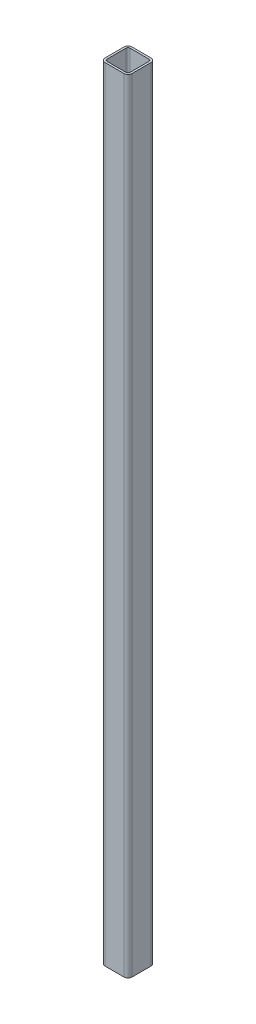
ISO-10303-21;
HEADER;
FILE_DESCRIPTION(('STEP AP214'),'2;1');
FILE_NAME('part.step','',(''),(''),'','','');
FILE_SCHEMA(('AUTOMOTIVE_DESIGN { 1 0 10303 214 1 1 1 1 }'));
ENDSEC;
DATA;
#1=APPLICATION_CONTEXT('core data for automotive mechanical design processes');
#2=APPLICATION_PROTOCOL_DEFINITION('international standard','automotive_design',2000,#1);
#3=PRODUCT_CONTEXT('',#1,'mechanical');
#4=PRODUCT('Part','Part','',(#3));
#5=PRODUCT_RELATED_PRODUCT_CATEGORY('part','',(#4));
#6=PRODUCT_DEFINITION_FORMATION('','',#4);
#7=PRODUCT_DEFINITION_CONTEXT('part definition',#1,'design');
#8=PRODUCT_DEFINITION('design','',#6,#7);
#9=PRODUCT_DEFINITION_SHAPE('','',#8);
#10=(LENGTH_UNIT() NAMED_UNIT(*) SI_UNIT(.MILLI.,.METRE.));
#11=(NAMED_UNIT(*) PLANE_ANGLE_UNIT() SI_UNIT($,.RADIAN.));
#12=(NAMED_UNIT(*) SI_UNIT($,.STERADIAN.) SOLID_ANGLE_UNIT());
#13=UNCERTAINTY_MEASURE_WITH_UNIT(LENGTH_MEASURE(1.E-05),#10,'distance_accuracy_value','');
#14=(GEOMETRIC_REPRESENTATION_CONTEXT(3) GLOBAL_UNCERTAINTY_ASSIGNED_CONTEXT((#13)) GLOBAL_UNIT_ASSIGNED_CONTEXT((#10,
#11,#12)) REPRESENTATION_CONTEXT('',''));
#15=CARTESIAN_POINT('',(0.,0.,0.));
#16=DIRECTION('',(0.,0.,1.));
#17=DIRECTION('',(1.,0.,0.));
#18=AXIS2_PLACEMENT_3D('',#15,#16,#17);
#19=CARTESIAN_POINT('',(-6.9999999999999,289.5,-7.00000000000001));
#20=DIRECTION('',(0.,1.,0.));
#21=DIRECTION('',(0.,0.,1.));
#22=AXIS2_PLACEMENT_3D('',#19,#20,#21);
#23=PLANE('',#22);
#24=CARTESIAN_POINT('',(-6.9999999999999,289.5,-7.00000000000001));
#25=DIRECTION('',(0.,1.,0.));
#26=DIRECTION('',(0.,0.,1.));
#27=AXIS2_PLACEMENT_3D('',#24,#25,#26);
#28=CIRCLE('',#27,3.);
#29=CARTESIAN_POINT('',(-6.9999999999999,289.5,-10.));
#30=VERTEX_POINT('',#29);
#31=CARTESIAN_POINT('',(-9.9999999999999,289.5,-7.00000000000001));
#32=VERTEX_POINT('',#31);
#33=EDGE_CURVE('E312',#30,#32,#28,.T.);
#34=ORIENTED_EDGE('',*,*,#33,.T.);
#35=DIRECTION('',(0.,0.,1.));
#36=VECTOR('',#35,1.);
#37=CARTESIAN_POINT('',(-9.9999999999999,289.5,7.00000000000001));
#38=LINE('',#37,#36);
#39=CARTESIAN_POINT('',(-9.9999999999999,289.5,7.00000000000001));
#40=VERTEX_POINT('',#39);
#41=EDGE_CURVE('E316',#32,#40,#38,.T.);
#42=ORIENTED_EDGE('',*,*,#41,.T.);
#43=CARTESIAN_POINT('',(-6.9999999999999,289.5,7.00000000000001));
#44=DIRECTION('',(0.,1.,0.));
#45=DIRECTION('',(0.,0.,-1.));
#46=AXIS2_PLACEMENT_3D('',#43,#44,#45);
#47=CIRCLE('',#46,3.);
#48=CARTESIAN_POINT('',(-6.9999999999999,289.5,10.));
#49=VERTEX_POINT('',#48);
#50=EDGE_CURVE('E319',#40,#49,#47,.T.);
#51=ORIENTED_EDGE('',*,*,#50,.T.);
#52=DIRECTION('',(1.,0.,0.));
#53=VECTOR('',#52,1.);
#54=CARTESIAN_POINT('',(-6.9999999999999,289.5,10.));
#55=LINE('',#54,#53);
#56=CARTESIAN_POINT('',(7.00000000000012,289.5,10.));
#57=VERTEX_POINT('',#56);
#58=EDGE_CURVE('E322',#49,#57,#55,.T.);
#59=ORIENTED_EDGE('',*,*,#58,.T.);
#60=CARTESIAN_POINT('',(7.00000000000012,289.5,7.00000000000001));
#61=DIRECTION('',(0.,1.,0.));
#62=DIRECTION('',(0.,0.,-1.));
#63=AXIS2_PLACEMENT_3D('',#60,#61,#62);
#64=CIRCLE('',#63,3.);
#65=CARTESIAN_POINT('',(10.0000000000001,289.5,7.00000000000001));
#66=VERTEX_POINT('',#65);
#67=EDGE_CURVE('E325',#57,#66,#64,.T.);
#68=ORIENTED_EDGE('',*,*,#67,.T.);
#69=DIRECTION('',(0.,0.,-1.));
#70=VECTOR('',#69,1.);
#71=CARTESIAN_POINT('',(10.0000000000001,289.5,7.00000000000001));
#72=LINE('',#71,#70);
#73=CARTESIAN_POINT('',(10.0000000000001,289.5,-7.00000000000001));
#74=VERTEX_POINT('',#73);
#75=EDGE_CURVE('E328',#66,#74,#72,.T.);
#76=ORIENTED_EDGE('',*,*,#75,.T.);
#77=CARTESIAN_POINT('',(7.00000000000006,289.5,-7.00000000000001));
#78=DIRECTION('',(0.,1.,0.));
#79=DIRECTION('',(0.,0.,1.));
#80=AXIS2_PLACEMENT_3D('',#77,#78,#79);
#81=CIRCLE('',#80,3.);
#82=CARTESIAN_POINT('',(7.00000000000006,289.5,-10.));
#83=VERTEX_POINT('',#82);
#84=EDGE_CURVE('E331',#74,#83,#81,.T.);
#85=ORIENTED_EDGE('',*,*,#84,.T.);
#86=DIRECTION('',(-1.,0.,0.));
#87=VECTOR('',#86,1.);
#88=CARTESIAN_POINT('',(-6.9999999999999,289.5,-10.));
#89=LINE('',#88,#87);
#90=EDGE_CURVE('E334',#83,#30,#89,.T.);
#91=ORIENTED_EDGE('',*,*,#90,.T.);
#92=EDGE_LOOP('',(#34,#42,#51,#59,#68,#76,#85,#91));
#93=FACE_BOUND('',#92,.T.);
#94=DIRECTION('',(0.,0.,1.));
#95=VECTOR('',#94,1.);
#96=CARTESIAN_POINT('',(-8.4999999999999,289.5,7.00000000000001));
#97=LINE('',#96,#95);
#98=CARTESIAN_POINT('',(-8.4999999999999,289.5,-7.00000000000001));
#99=VERTEX_POINT('',#98);
#100=CARTESIAN_POINT('',(-8.4999999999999,289.5,7.00000000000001));
#101=VERTEX_POINT('',#100);
#102=EDGE_CURVE('E250',#99,#101,#97,.T.);
#103=ORIENTED_EDGE('',*,*,#102,.F.);
#104=CARTESIAN_POINT('',(-6.9999999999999,289.5,-7.00000000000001));
#105=DIRECTION('',(0.,1.,0.));
#106=DIRECTION('',(1.,0.,0.));
#107=AXIS2_PLACEMENT_3D('',#104,#105,#106);
#108=CIRCLE('',#107,1.5);
#109=CARTESIAN_POINT('',(-6.9999999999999,289.5,-8.50000000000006));
#110=VERTEX_POINT('',#109);
#111=EDGE_CURVE('E216',#110,#99,#108,.T.);
#112=ORIENTED_EDGE('',*,*,#111,.F.);
#113=DIRECTION('',(-1.,0.,0.));
#114=VECTOR('',#113,1.);
#115=CARTESIAN_POINT('',(-6.9999999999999,289.5,-8.50000000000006));
#116=LINE('',#115,#114);
#117=CARTESIAN_POINT('',(7.00000000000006,289.5,-8.50000000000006));
#118=VERTEX_POINT('',#117);
#119=EDGE_CURVE('E268',#118,#110,#116,.T.);
#120=ORIENTED_EDGE('',*,*,#119,.F.);
#121=CARTESIAN_POINT('',(7.00000000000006,289.5,-7.00000000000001));
#122=DIRECTION('',(0.,1.,0.));
#123=DIRECTION('',(1.,0.,0.));
#124=AXIS2_PLACEMENT_3D('',#121,#122,#123);
#125=CIRCLE('',#124,1.5);
#126=CARTESIAN_POINT('',(8.50000000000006,289.5,-7.00000000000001));
#127=VERTEX_POINT('',#126);
#128=EDGE_CURVE('E265',#127,#118,#125,.T.);
#129=ORIENTED_EDGE('',*,*,#128,.F.);
#130=DIRECTION('',(0.,0.,-1.));
#131=VECTOR('',#130,1.);
#132=CARTESIAN_POINT('',(8.50000000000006,289.5,7.00000000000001));
#133=LINE('',#132,#131);
#134=CARTESIAN_POINT('',(8.50000000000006,289.5,7.00000000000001));
#135=VERTEX_POINT('',#134);
#136=EDGE_CURVE('E262',#135,#127,#133,.T.);
#137=ORIENTED_EDGE('',*,*,#136,.F.);
#138=CARTESIAN_POINT('',(7.00000000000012,289.5,7.00000000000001));
#139=DIRECTION('',(0.,1.,0.));
#140=DIRECTION('',(1.,0.,0.));
#141=AXIS2_PLACEMENT_3D('',#138,#139,#140);
#142=CIRCLE('',#141,1.5);
#143=CARTESIAN_POINT('',(7.00000000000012,289.5,8.49999999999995));
#144=VERTEX_POINT('',#143);
#145=EDGE_CURVE('E259',#144,#135,#142,.T.);
#146=ORIENTED_EDGE('',*,*,#145,.F.);
#147=DIRECTION('',(1.,0.,0.));
#148=VECTOR('',#147,1.);
#149=CARTESIAN_POINT('',(-6.9999999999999,289.5,8.49999999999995));
#150=LINE('',#149,#148);
#151=CARTESIAN_POINT('',(-6.9999999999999,289.5,8.49999999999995));
#152=VERTEX_POINT('',#151);
#153=EDGE_CURVE('E256',#152,#144,#150,.T.);
#154=ORIENTED_EDGE('',*,*,#153,.F.);
#155=CARTESIAN_POINT('',(-6.9999999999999,289.5,7.00000000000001));
#156=DIRECTION('',(0.,1.,0.));
#157=DIRECTION('',(1.,0.,0.));
#158=AXIS2_PLACEMENT_3D('',#155,#156,#157);
#159=CIRCLE('',#158,1.5);
#160=EDGE_CURVE('E253',#101,#152,#159,.T.);
#161=ORIENTED_EDGE('',*,*,#160,.F.);
#162=EDGE_LOOP('',(#103,#112,#120,#129,#137,#146,#154,#161));
#163=FACE_BOUND('',#162,.T.);
#164=ADVANCED_FACE('F86',(#93,#163),#23,.T.);
#165=CARTESIAN_POINT('',(-7.00000000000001,-289.5,-6.99999999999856));
#166=DIRECTION('',(0.,1.,0.));
#167=DIRECTION('',(0.,0.,1.));
#168=AXIS2_PLACEMENT_3D('',#165,#166,#167);
#169=PLANE('',#168);
#170=CARTESIAN_POINT('',(-7.00000000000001,-289.5,-6.99999999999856));
#171=DIRECTION('',(0.,1.,0.));
#172=DIRECTION('',(0.,0.,1.));
#173=AXIS2_PLACEMENT_3D('',#170,#171,#172);
#174=CIRCLE('',#173,3.);
#175=CARTESIAN_POINT('',(-7.00000000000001,-289.5,-9.99999999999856));
#176=VERTEX_POINT('',#175);
#177=CARTESIAN_POINT('',(-9.99999999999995,-289.5,-6.99999999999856));
#178=VERTEX_POINT('',#177);
#179=EDGE_CURVE('E218',#176,#178,#174,.T.);
#180=ORIENTED_EDGE('',*,*,#179,.F.);
#181=DIRECTION('',(-1.,0.,0.));
#182=VECTOR('',#181,1.);
#183=CARTESIAN_POINT('',(-7.00000000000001,-289.5,-9.99999999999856));
#184=LINE('',#183,#182);
#185=CARTESIAN_POINT('',(7.00000000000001,-289.5,-9.99999999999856));
#186=VERTEX_POINT('',#185);
#187=EDGE_CURVE('E309',#186,#176,#184,.T.);
#188=ORIENTED_EDGE('',*,*,#187,.F.);
#189=CARTESIAN_POINT('',(7.00000000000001,-289.5,-6.99999999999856));
#190=DIRECTION('',(0.,1.,0.));
#191=DIRECTION('',(0.,0.,1.));
#192=AXIS2_PLACEMENT_3D('',#189,#190,#191);
#193=CIRCLE('',#192,3.);
#194=CARTESIAN_POINT('',(10.,-289.5,-6.99999999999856));
#195=VERTEX_POINT('',#194);
#196=EDGE_CURVE('E306',#195,#186,#193,.T.);
#197=ORIENTED_EDGE('',*,*,#196,.F.);
#198=DIRECTION('',(0.,0.,-1.));
#199=VECTOR('',#198,1.);
#200=CARTESIAN_POINT('',(10.,-289.5,7.00000000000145));
#201=LINE('',#200,#199);
#202=CARTESIAN_POINT('',(10.,-289.5,7.00000000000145));
#203=VERTEX_POINT('',#202);
#204=EDGE_CURVE('E303',#203,#195,#201,.T.);
#205=ORIENTED_EDGE('',*,*,#204,.F.);
#206=CARTESIAN_POINT('',(7.00000000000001,-289.5,7.00000000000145));
#207=DIRECTION('',(0.,1.,0.));
#208=DIRECTION('',(0.,0.,-1.));
#209=AXIS2_PLACEMENT_3D('',#206,#207,#208);
#210=CIRCLE('',#209,3.);
#211=CARTESIAN_POINT('',(7.00000000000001,-289.5,10.0000000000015));
#212=VERTEX_POINT('',#211);
#213=EDGE_CURVE('E300',#212,#203,#210,.T.);
#214=ORIENTED_EDGE('',*,*,#213,.F.);
#215=DIRECTION('',(1.,0.,0.));
#216=VECTOR('',#215,1.);
#217=CARTESIAN_POINT('',(-6.99999999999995,-289.5,10.0000000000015));
#218=LINE('',#217,#216);
#219=CARTESIAN_POINT('',(-6.99999999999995,-289.5,10.0000000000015));
#220=VERTEX_POINT('',#219);
#221=EDGE_CURVE('E297',#220,#212,#218,.T.);
#222=ORIENTED_EDGE('',*,*,#221,.F.);
#223=CARTESIAN_POINT('',(-6.99999999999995,-289.5,7.00000000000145));
#224=DIRECTION('',(0.,1.,0.));
#225=DIRECTION('',(0.,0.,-1.));
#226=AXIS2_PLACEMENT_3D('',#223,#224,#225);
#227=CIRCLE('',#226,3.);
#228=CARTESIAN_POINT('',(-9.99999999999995,-289.5,7.00000000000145));
#229=VERTEX_POINT('',#228);
#230=EDGE_CURVE('E294',#229,#220,#227,.T.);
#231=ORIENTED_EDGE('',*,*,#230,.F.);
#232=DIRECTION('',(0.,0.,1.));
#233=VECTOR('',#232,1.);
#234=CARTESIAN_POINT('',(-9.99999999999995,-289.5,7.00000000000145));
#235=LINE('',#234,#233);
#236=EDGE_CURVE('E292',#178,#229,#235,.T.);
#237=ORIENTED_EDGE('',*,*,#236,.F.);
#238=EDGE_LOOP('',(#180,#188,#197,#205,#214,#222,#231,#237));
#239=FACE_BOUND('',#238,.T.);
#240=CARTESIAN_POINT('',(-7.00000000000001,-289.5,-6.99999999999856));
#241=DIRECTION('',(0.,1.,0.));
#242=DIRECTION('',(1.,0.,0.));
#243=AXIS2_PLACEMENT_3D('',#240,#241,#242);
#244=CIRCLE('',#243,1.5);
#245=CARTESIAN_POINT('',(-7.00000000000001,-289.5,-8.49999999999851));
#246=VERTEX_POINT('',#245);
#247=CARTESIAN_POINT('',(-8.49999999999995,-289.5,-6.99999999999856));
#248=VERTEX_POINT('',#247);
#249=EDGE_CURVE('E110',#246,#248,#244,.T.);
#250=ORIENTED_EDGE('',*,*,#249,.T.);
#251=DIRECTION('',(0.,0.,1.));
#252=VECTOR('',#251,1.);
#253=CARTESIAN_POINT('',(-8.49999999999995,-289.5,7.00000000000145));
#254=LINE('',#253,#252);
#255=CARTESIAN_POINT('',(-8.49999999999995,-289.5,7.00000000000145));
#256=VERTEX_POINT('',#255);
#257=EDGE_CURVE('E202',#248,#256,#254,.T.);
#258=ORIENTED_EDGE('',*,*,#257,.T.);
#259=CARTESIAN_POINT('',(-6.99999999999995,-289.5,7.00000000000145));
#260=DIRECTION('',(0.,1.,0.));
#261=DIRECTION('',(1.,0.,0.));
#262=AXIS2_PLACEMENT_3D('',#259,#260,#261);
#263=CIRCLE('',#262,1.5);
#264=CARTESIAN_POINT('',(-6.99999999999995,-289.5,8.50000000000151));
#265=VERTEX_POINT('',#264);
#266=EDGE_CURVE('E212',#256,#265,#263,.T.);
#267=ORIENTED_EDGE('',*,*,#266,.T.);
#268=DIRECTION('',(1.,0.,0.));
#269=VECTOR('',#268,1.);
#270=CARTESIAN_POINT('',(-6.99999999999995,-289.5,8.50000000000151));
#271=LINE('',#270,#269);
#272=CARTESIAN_POINT('',(7.00000000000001,-289.5,8.50000000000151));
#273=VERTEX_POINT('',#272);
#274=EDGE_CURVE('E231',#265,#273,#271,.T.);
#275=ORIENTED_EDGE('',*,*,#274,.T.);
#276=CARTESIAN_POINT('',(7.00000000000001,-289.5,7.00000000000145));
#277=DIRECTION('',(0.,1.,0.));
#278=DIRECTION('',(1.,0.,0.));
#279=AXIS2_PLACEMENT_3D('',#276,#277,#278);
#280=CIRCLE('',#279,1.5);
#281=CARTESIAN_POINT('',(8.50000000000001,-289.5,7.00000000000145));
#282=VERTEX_POINT('',#281);
#283=EDGE_CURVE('E235',#273,#282,#280,.T.);
#284=ORIENTED_EDGE('',*,*,#283,.T.);
#285=DIRECTION('',(0.,0.,-1.));
#286=VECTOR('',#285,1.);
#287=CARTESIAN_POINT('',(8.50000000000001,-289.5,7.00000000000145));
#288=LINE('',#287,#286);
#289=CARTESIAN_POINT('',(8.50000000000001,-289.5,-6.99999999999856));
#290=VERTEX_POINT('',#289);
#291=EDGE_CURVE('E239',#282,#290,#288,.T.);
#292=ORIENTED_EDGE('',*,*,#291,.T.);
#293=CARTESIAN_POINT('',(7.00000000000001,-289.5,-6.99999999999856));
#294=DIRECTION('',(0.,1.,0.));
#295=DIRECTION('',(1.,0.,0.));
#296=AXIS2_PLACEMENT_3D('',#293,#294,#295);
#297=CIRCLE('',#296,1.5);
#298=CARTESIAN_POINT('',(7.00000000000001,-289.5,-8.49999999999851));
#299=VERTEX_POINT('',#298);
#300=EDGE_CURVE('E243',#290,#299,#297,.T.);
#301=ORIENTED_EDGE('',*,*,#300,.T.);
#302=DIRECTION('',(-1.,0.,0.));
#303=VECTOR('',#302,1.);
#304=CARTESIAN_POINT('',(-7.00000000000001,-289.5,-8.49999999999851));
#305=LINE('',#304,#303);
#306=EDGE_CURVE('E223',#299,#246,#305,.T.);
#307=ORIENTED_EDGE('',*,*,#306,.T.);
#308=EDGE_LOOP('',(#250,#258,#267,#275,#284,#292,#301,#307));
#309=FACE_BOUND('',#308,.T.);
#310=ADVANCED_FACE('F221',(#239,#309),#169,.F.);
#311=CARTESIAN_POINT('',(-6.9999999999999,289.5,-7.00000000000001));
#312=DIRECTION('',(0.,-1.,0.));
#313=DIRECTION('',(0.,0.,-1.));
#314=AXIS2_PLACEMENT_3D('',#311,#312,#313);
#315=CYLINDRICAL_SURFACE('',#314,3.);
#316=ORIENTED_EDGE('',*,*,#179,.T.);
#317=DIRECTION('',(0.,-1.,0.));
#318=VECTOR('',#317,1.);
#319=CARTESIAN_POINT('',(-9.9999999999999,289.5,-7.00000000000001));
#320=LINE('',#319,#318);
#321=EDGE_CURVE('E12',#32,#178,#320,.T.);
#322=ORIENTED_EDGE('',*,*,#321,.F.);
#323=ORIENTED_EDGE('',*,*,#33,.F.);
#324=DIRECTION('',(0.,-1.,0.));
#325=VECTOR('',#324,1.);
#326=CARTESIAN_POINT('',(-6.9999999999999,289.5,-10.));
#327=LINE('',#326,#325);
#328=EDGE_CURVE('E337',#30,#176,#327,.T.);
#329=ORIENTED_EDGE('',*,*,#328,.T.);
#330=EDGE_LOOP('',(#316,#322,#323,#329));
#331=FACE_BOUND('',#330,.T.);
#332=ADVANCED_FACE('F88',(#331),#315,.T.);
#333=CARTESIAN_POINT('',(-9.9999999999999,289.5,7.00000000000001));
#334=DIRECTION('',(1.,0.,0.));
#335=DIRECTION('',(0.,0.,-1.));
#336=AXIS2_PLACEMENT_3D('',#333,#334,#335);
#337=PLANE('',#336);
#338=ORIENTED_EDGE('',*,*,#236,.T.);
#339=DIRECTION('',(0.,-1.,0.));
#340=VECTOR('',#339,1.);
#341=CARTESIAN_POINT('',(-9.9999999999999,289.5,7.00000000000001));
#342=LINE('',#341,#340);
#343=EDGE_CURVE('E95',#40,#229,#342,.T.);
#344=ORIENTED_EDGE('',*,*,#343,.F.);
#345=ORIENTED_EDGE('',*,*,#41,.F.);
#346=ORIENTED_EDGE('',*,*,#321,.T.);
#347=EDGE_LOOP('',(#338,#344,#345,#346));
#348=FACE_BOUND('',#347,.T.);
#349=ADVANCED_FACE('F388',(#348),#337,.F.);
#350=CARTESIAN_POINT('',(-6.9999999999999,289.5,7.00000000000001));
#351=DIRECTION('',(0.,-1.,0.));
#352=DIRECTION('',(0.,0.,-1.));
#353=AXIS2_PLACEMENT_3D('',#350,#351,#352);
#354=CYLINDRICAL_SURFACE('',#353,3.);
#355=ORIENTED_EDGE('',*,*,#230,.T.);
#356=DIRECTION('',(0.,-1.,0.));
#357=VECTOR('',#356,1.);
#358=CARTESIAN_POINT('',(-6.9999999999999,289.5,10.));
#359=LINE('',#358,#357);
#360=EDGE_CURVE('E357',#49,#220,#359,.T.);
#361=ORIENTED_EDGE('',*,*,#360,.F.);
#362=ORIENTED_EDGE('',*,*,#50,.F.);
#363=ORIENTED_EDGE('',*,*,#343,.T.);
#364=EDGE_LOOP('',(#355,#361,#362,#363));
#365=FACE_BOUND('',#364,.T.);
#366=ADVANCED_FACE('F366',(#365),#354,.T.);
#367=CARTESIAN_POINT('',(-6.9999999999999,289.5,10.));
#368=DIRECTION('',(0.,0.,-1.));
#369=DIRECTION('',(-1.,0.,0.));
#370=AXIS2_PLACEMENT_3D('',#367,#368,#369);
#371=PLANE('',#370);
#372=ORIENTED_EDGE('',*,*,#221,.T.);
#373=DIRECTION('',(0.,-1.,0.));
#374=VECTOR('',#373,1.);
#375=CARTESIAN_POINT('',(7.00000000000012,289.5,10.));
#376=LINE('',#375,#374);
#377=EDGE_CURVE('E353',#57,#212,#376,.T.);
#378=ORIENTED_EDGE('',*,*,#377,.F.);
#379=ORIENTED_EDGE('',*,*,#58,.F.);
#380=ORIENTED_EDGE('',*,*,#360,.T.);
#381=EDGE_LOOP('',(#372,#378,#379,#380));
#382=FACE_BOUND('',#381,.T.);
#383=ADVANCED_FACE('F376',(#382),#371,.F.);
#384=CARTESIAN_POINT('',(7.00000000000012,289.5,7.00000000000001));
#385=DIRECTION('',(0.,-1.,0.));
#386=DIRECTION('',(0.,0.,-1.));
#387=AXIS2_PLACEMENT_3D('',#384,#385,#386);
#388=CYLINDRICAL_SURFACE('',#387,3.);
#389=ORIENTED_EDGE('',*,*,#213,.T.);
#390=DIRECTION('',(0.,-1.,0.));
#391=VECTOR('',#390,1.);
#392=CARTESIAN_POINT('',(10.0000000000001,289.5,7.00000000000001));
#393=LINE('',#392,#391);
#394=EDGE_CURVE('E349',#66,#203,#393,.T.);
#395=ORIENTED_EDGE('',*,*,#394,.F.);
#396=ORIENTED_EDGE('',*,*,#67,.F.);
#397=ORIENTED_EDGE('',*,*,#377,.T.);
#398=EDGE_LOOP('',(#389,#395,#396,#397));
#399=FACE_BOUND('',#398,.T.);
#400=ADVANCED_FACE('F380',(#399),#388,.T.);
#401=CARTESIAN_POINT('',(10.0000000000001,289.5,7.00000000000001));
#402=DIRECTION('',(-1.,0.,0.));
#403=DIRECTION('',(0.,0.,1.));
#404=AXIS2_PLACEMENT_3D('',#401,#402,#403);
#405=PLANE('',#404);
#406=ORIENTED_EDGE('',*,*,#204,.T.);
#407=DIRECTION('',(0.,-1.,0.));
#408=VECTOR('',#407,1.);
#409=CARTESIAN_POINT('',(10.0000000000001,289.5,-7.00000000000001));
#410=LINE('',#409,#408);
#411=EDGE_CURVE('E345',#74,#195,#410,.T.);
#412=ORIENTED_EDGE('',*,*,#411,.F.);
#413=ORIENTED_EDGE('',*,*,#75,.F.);
#414=ORIENTED_EDGE('',*,*,#394,.T.);
#415=EDGE_LOOP('',(#406,#412,#413,#414));
#416=FACE_BOUND('',#415,.T.);
#417=ADVANCED_FACE('F401',(#416),#405,.F.);
#418=CARTESIAN_POINT('',(7.00000000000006,289.5,-7.00000000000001));
#419=DIRECTION('',(0.,-1.,0.));
#420=DIRECTION('',(0.,0.,-1.));
#421=AXIS2_PLACEMENT_3D('',#418,#419,#420);
#422=CYLINDRICAL_SURFACE('',#421,3.);
#423=ORIENTED_EDGE('',*,*,#196,.T.);
#424=DIRECTION('',(0.,-1.,0.));
#425=VECTOR('',#424,1.);
#426=CARTESIAN_POINT('',(7.00000000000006,289.5,-10.));
#427=LINE('',#426,#425);
#428=EDGE_CURVE('E341',#83,#186,#427,.T.);
#429=ORIENTED_EDGE('',*,*,#428,.F.);
#430=ORIENTED_EDGE('',*,*,#84,.F.);
#431=ORIENTED_EDGE('',*,*,#411,.T.);
#432=EDGE_LOOP('',(#423,#429,#430,#431));
#433=FACE_BOUND('',#432,.T.);
#434=ADVANCED_FACE('F399',(#433),#422,.T.);
#435=CARTESIAN_POINT('',(-6.9999999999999,289.5,-10.));
#436=DIRECTION('',(0.,0.,1.));
#437=DIRECTION('',(1.,0.,0.));
#438=AXIS2_PLACEMENT_3D('',#435,#436,#437);
#439=PLANE('',#438);
#440=ORIENTED_EDGE('',*,*,#187,.T.);
#441=ORIENTED_EDGE('',*,*,#328,.F.);
#442=ORIENTED_EDGE('',*,*,#90,.F.);
#443=ORIENTED_EDGE('',*,*,#428,.T.);
#444=EDGE_LOOP('',(#440,#441,#442,#443));
#445=FACE_BOUND('',#444,.T.);
#446=ADVANCED_FACE('F394',(#445),#439,.F.);
#447=CARTESIAN_POINT('',(-6.9999999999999,289.5,-7.00000000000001));
#448=DIRECTION('',(0.,-1.,0.));
#449=DIRECTION('',(0.,0.,-1.));
#450=AXIS2_PLACEMENT_3D('',#447,#448,#449);
#451=CYLINDRICAL_SURFACE('',#450,1.5);
#452=ORIENTED_EDGE('',*,*,#249,.F.);
#453=DIRECTION('',(0.,-1.,0.));
#454=VECTOR('',#453,1.);
#455=CARTESIAN_POINT('',(-6.9999999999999,289.5,-8.50000000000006));
#456=LINE('',#455,#454);
#457=EDGE_CURVE('E271',#110,#246,#456,.T.);
#458=ORIENTED_EDGE('',*,*,#457,.F.);
#459=ORIENTED_EDGE('',*,*,#111,.T.);
#460=DIRECTION('',(0.,-1.,0.));
#461=VECTOR('',#460,1.);
#462=CARTESIAN_POINT('',(-8.4999999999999,289.5,-7.00000000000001));
#463=LINE('',#462,#461);
#464=EDGE_CURVE('E204',#99,#248,#463,.T.);
#465=ORIENTED_EDGE('',*,*,#464,.T.);
#466=EDGE_LOOP('',(#452,#458,#459,#465));
#467=FACE_BOUND('',#466,.T.);
#468=ADVANCED_FACE('F214',(#467),#451,.F.);
#469=CARTESIAN_POINT('',(-8.4999999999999,289.5,7.00000000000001));
#470=DIRECTION('',(1.,0.,0.));
#471=DIRECTION('',(0.,0.,-1.));
#472=AXIS2_PLACEMENT_3D('',#469,#470,#471);
#473=PLANE('',#472);
#474=ORIENTED_EDGE('',*,*,#257,.F.);
#475=ORIENTED_EDGE('',*,*,#464,.F.);
#476=ORIENTED_EDGE('',*,*,#102,.T.);
#477=DIRECTION('',(0.,-1.,0.));
#478=VECTOR('',#477,1.);
#479=CARTESIAN_POINT('',(-8.4999999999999,289.5,7.00000000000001));
#480=LINE('',#479,#478);
#481=EDGE_CURVE('E207',#101,#256,#480,.T.);
#482=ORIENTED_EDGE('',*,*,#481,.T.);
#483=EDGE_LOOP('',(#474,#475,#476,#482));
#484=FACE_BOUND('',#483,.T.);
#485=ADVANCED_FACE('F203',(#484),#473,.T.);
#486=CARTESIAN_POINT('',(-6.9999999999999,289.5,7.00000000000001));
#487=DIRECTION('',(0.,-1.,0.));
#488=DIRECTION('',(0.,0.,-1.));
#489=AXIS2_PLACEMENT_3D('',#486,#487,#488);
#490=CYLINDRICAL_SURFACE('',#489,1.5);
#491=ORIENTED_EDGE('',*,*,#266,.F.);
#492=ORIENTED_EDGE('',*,*,#481,.F.);
#493=ORIENTED_EDGE('',*,*,#160,.T.);
#494=DIRECTION('',(0.,-1.,0.));
#495=VECTOR('',#494,1.);
#496=CARTESIAN_POINT('',(-6.9999999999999,289.5,8.49999999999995));
#497=LINE('',#496,#495);
#498=EDGE_CURVE('E284',#152,#265,#497,.T.);
#499=ORIENTED_EDGE('',*,*,#498,.T.);
#500=EDGE_LOOP('',(#491,#492,#493,#499));
#501=FACE_BOUND('',#500,.T.);
#502=ADVANCED_FACE('F425',(#501),#490,.F.);
#503=CARTESIAN_POINT('',(-6.9999999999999,289.5,8.49999999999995));
#504=DIRECTION('',(0.,0.,-1.));
#505=DIRECTION('',(-1.,0.,0.));
#506=AXIS2_PLACEMENT_3D('',#503,#504,#505);
#507=PLANE('',#506);
#508=ORIENTED_EDGE('',*,*,#274,.F.);
#509=ORIENTED_EDGE('',*,*,#498,.F.);
#510=ORIENTED_EDGE('',*,*,#153,.T.);
#511=DIRECTION('',(0.,-1.,0.));
#512=VECTOR('',#511,1.);
#513=CARTESIAN_POINT('',(7.00000000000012,289.5,8.49999999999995));
#514=LINE('',#513,#512);
#515=EDGE_CURVE('E281',#144,#273,#514,.T.);
#516=ORIENTED_EDGE('',*,*,#515,.T.);
#517=EDGE_LOOP('',(#508,#509,#510,#516));
#518=FACE_BOUND('',#517,.T.);
#519=ADVANCED_FACE('F430',(#518),#507,.T.);
#520=CARTESIAN_POINT('',(7.00000000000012,289.5,7.00000000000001));
#521=DIRECTION('',(0.,-1.,0.));
#522=DIRECTION('',(0.,0.,-1.));
#523=AXIS2_PLACEMENT_3D('',#520,#521,#522);
#524=CYLINDRICAL_SURFACE('',#523,1.5);
#525=ORIENTED_EDGE('',*,*,#283,.F.);
#526=ORIENTED_EDGE('',*,*,#515,.F.);
#527=ORIENTED_EDGE('',*,*,#145,.T.);
#528=DIRECTION('',(0.,-1.,0.));
#529=VECTOR('',#528,1.);
#530=CARTESIAN_POINT('',(8.50000000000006,289.5,7.00000000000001));
#531=LINE('',#530,#529);
#532=EDGE_CURVE('E279',#135,#282,#531,.T.);
#533=ORIENTED_EDGE('',*,*,#532,.T.);
#534=EDGE_LOOP('',(#525,#526,#527,#533));
#535=FACE_BOUND('',#534,.T.);
#536=ADVANCED_FACE('F434',(#535),#524,.F.);
#537=CARTESIAN_POINT('',(8.50000000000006,289.5,7.00000000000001));
#538=DIRECTION('',(-1.,0.,0.));
#539=DIRECTION('',(0.,0.,1.));
#540=AXIS2_PLACEMENT_3D('',#537,#538,#539);
#541=PLANE('',#540);
#542=ORIENTED_EDGE('',*,*,#291,.F.);
#543=ORIENTED_EDGE('',*,*,#532,.F.);
#544=ORIENTED_EDGE('',*,*,#136,.T.);
#545=DIRECTION('',(0.,-1.,0.));
#546=VECTOR('',#545,1.);
#547=CARTESIAN_POINT('',(8.50000000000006,289.5,-7.00000000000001));
#548=LINE('',#547,#546);
#549=EDGE_CURVE('E276',#127,#290,#548,.T.);
#550=ORIENTED_EDGE('',*,*,#549,.T.);
#551=EDGE_LOOP('',(#542,#543,#544,#550));
#552=FACE_BOUND('',#551,.T.);
#553=ADVANCED_FACE('F438',(#552),#541,.T.);
#554=CARTESIAN_POINT('',(7.00000000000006,289.5,-7.00000000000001));
#555=DIRECTION('',(0.,-1.,0.));
#556=DIRECTION('',(0.,0.,-1.));
#557=AXIS2_PLACEMENT_3D('',#554,#555,#556);
#558=CYLINDRICAL_SURFACE('',#557,1.5);
#559=ORIENTED_EDGE('',*,*,#300,.F.);
#560=ORIENTED_EDGE('',*,*,#549,.F.);
#561=ORIENTED_EDGE('',*,*,#128,.T.);
#562=DIRECTION('',(0.,-1.,0.));
#563=VECTOR('',#562,1.);
#564=CARTESIAN_POINT('',(7.00000000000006,289.5,-8.50000000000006));
#565=LINE('',#564,#563);
#566=EDGE_CURVE('E102',#118,#299,#565,.T.);
#567=ORIENTED_EDGE('',*,*,#566,.T.);
#568=EDGE_LOOP('',(#559,#560,#561,#567));
#569=FACE_BOUND('',#568,.T.);
#570=ADVANCED_FACE('F442',(#569),#558,.F.);
#571=CARTESIAN_POINT('',(-6.9999999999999,289.5,-8.50000000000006));
#572=DIRECTION('',(0.,0.,1.));
#573=DIRECTION('',(1.,0.,0.));
#574=AXIS2_PLACEMENT_3D('',#571,#572,#573);
#575=PLANE('',#574);
#576=ORIENTED_EDGE('',*,*,#306,.F.);
#577=ORIENTED_EDGE('',*,*,#566,.F.);
#578=ORIENTED_EDGE('',*,*,#119,.T.);
#579=ORIENTED_EDGE('',*,*,#457,.T.);
#580=EDGE_LOOP('',(#576,#577,#578,#579));
#581=FACE_BOUND('',#580,.T.);
#582=ADVANCED_FACE('F446',(#581),#575,.T.);
#583=CLOSED_SHELL('',(#164,#310,#332,#349,#366,#383,#400,#417,#434,#446,#468,#485,#502,#519,
#536,#553,#570,#582));
#584=MANIFOLD_SOLID_BREP('B2',#583);
#585=ADVANCED_BREP_SHAPE_REPRESENTATION('',(#18,#584),#14);
#586=SHAPE_DEFINITION_REPRESENTATION(#9,#585);
ENDSEC;
END-ISO-10303-21;
